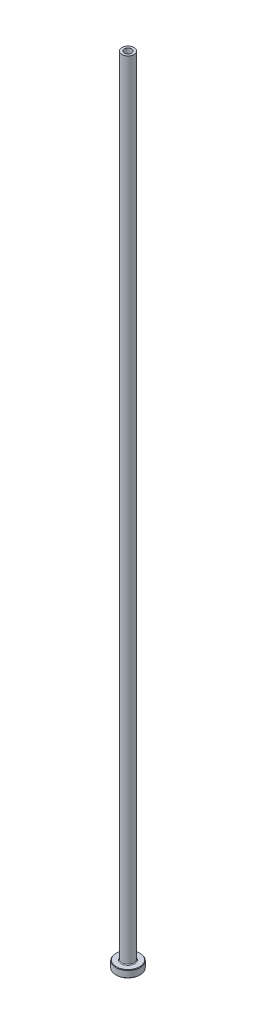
from build123d import *

# Parameters (mm, degrees)
FILLET1_R     = 0.3
CHAMFER1_SIZE = 0.2
CHAMFER3_SIZE = 0.5


with BuildPart() as part:
    # Sketch1 → Revolve1 (revolve)
    with BuildSketch(Plane.XY, mode=Mode.PRIVATE) as revolve1_sk:
        Polygon((-1.5, 325), (-2.5, 325), (-2.5, 3), (-5, 3), (-5, 0), (-1.75, 0), (-1.75, 268), (-1.5, 280), align=None)
    revolve(revolve1_sk.sketch.rotate(Axis((0, 92.187680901, 0), (0, -1, 0)), 270), axis=Axis((0, 92.187680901, 0), (0, -1, 0)))

    # Fillet1
    fillet1_edges = [part.edges().sort_by_distance(p)[0] for p in [
        (0, 3, -2.5),
    ]]
    fillet(fillet1_edges, radius=FILLET1_R)

    # Chamfer1
    chamfer1_edges = [part.edges().sort_by_distance(p)[0] for p in [
        (0, 0, -5),
        (0, 3, -5),
    ]]
    chamfer(chamfer1_edges, length=CHAMFER1_SIZE)

    # Chamfer3
    chamfer3_edges = [part.edges().sort_by_distance(p)[0] for p in [
        (0, 0, -1.75),
    ]]
    chamfer(chamfer3_edges, length=CHAMFER3_SIZE)


solid = part.part
